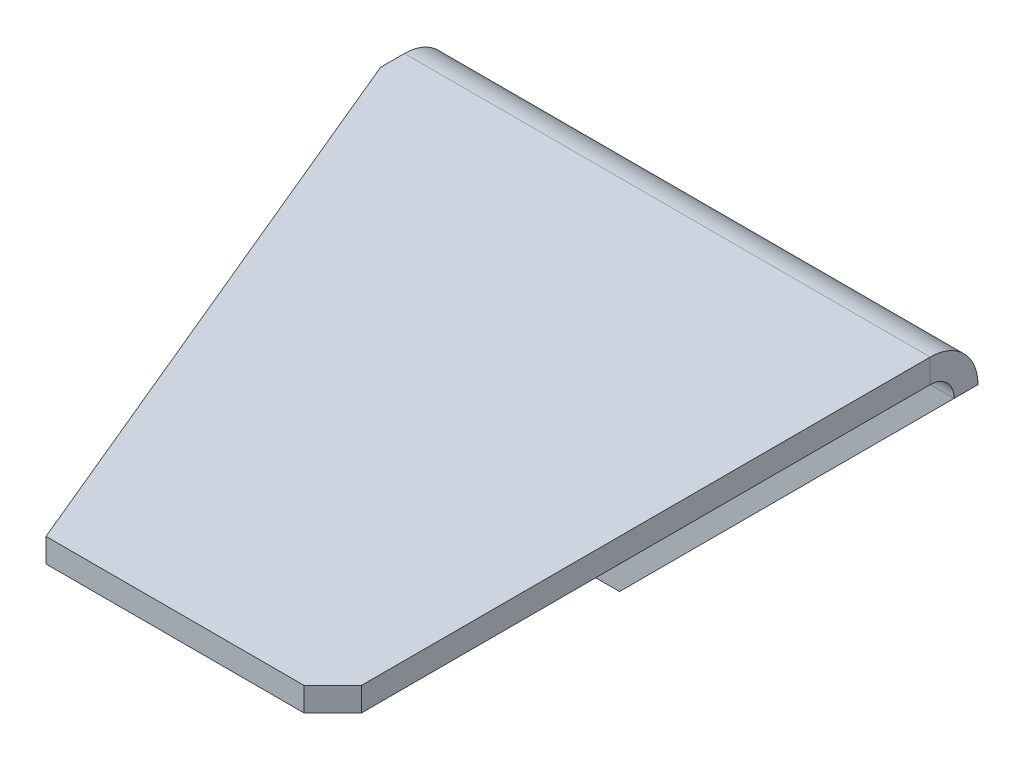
ISO-10303-21;
HEADER;
FILE_DESCRIPTION(('STEP AP214'),'2;1');
FILE_NAME('part.step','',(''),(''),'','','');
FILE_SCHEMA(('AUTOMOTIVE_DESIGN { 1 0 10303 214 1 1 1 1 }'));
ENDSEC;
DATA;
#1=APPLICATION_CONTEXT('core data for automotive mechanical design processes');
#2=APPLICATION_PROTOCOL_DEFINITION('international standard','automotive_design',2000,#1);
#3=PRODUCT_CONTEXT('',#1,'mechanical');
#4=PRODUCT('Part','Part','',(#3));
#5=PRODUCT_RELATED_PRODUCT_CATEGORY('part','',(#4));
#6=PRODUCT_DEFINITION_FORMATION('','',#4);
#7=PRODUCT_DEFINITION_CONTEXT('part definition',#1,'design');
#8=PRODUCT_DEFINITION('design','',#6,#7);
#9=PRODUCT_DEFINITION_SHAPE('','',#8);
#10=(LENGTH_UNIT() NAMED_UNIT(*) SI_UNIT(.MILLI.,.METRE.));
#11=(NAMED_UNIT(*) PLANE_ANGLE_UNIT() SI_UNIT($,.RADIAN.));
#12=(NAMED_UNIT(*) SI_UNIT($,.STERADIAN.) SOLID_ANGLE_UNIT());
#13=UNCERTAINTY_MEASURE_WITH_UNIT(LENGTH_MEASURE(1.E-05),#10,'distance_accuracy_value','');
#14=(GEOMETRIC_REPRESENTATION_CONTEXT(3) GLOBAL_UNCERTAINTY_ASSIGNED_CONTEXT((#13)) GLOBAL_UNIT_ASSIGNED_CONTEXT((#10,
#11,#12)) REPRESENTATION_CONTEXT('',''));
#15=CARTESIAN_POINT('',(0.,0.,0.));
#16=DIRECTION('',(0.,0.,1.));
#17=DIRECTION('',(1.,0.,0.));
#18=AXIS2_PLACEMENT_3D('',#15,#16,#17);
#19=CARTESIAN_POINT('',(-962.500000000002,-5.00000000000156,-67.4999999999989));
#20=DIRECTION('',(-1.,0.,0.));
#21=DIRECTION('',(0.,0.,-1.));
#22=AXIS2_PLACEMENT_3D('',#19,#20,#21);
#23=PLANE('',#22);
#24=DIRECTION('',(0.,0.,1.));
#25=VECTOR('',#24,1.);
#26=CARTESIAN_POINT('',(-962.500000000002,-5.00000000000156,-67.4999999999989));
#27=LINE('',#26,#25);
#28=CARTESIAN_POINT('',(-962.500000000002,-5.00000000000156,-67.4999999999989));
#29=VERTEX_POINT('',#28);
#30=CARTESIAN_POINT('',(-962.500000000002,-5.00000000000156,-64.999999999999));
#31=VERTEX_POINT('',#30);
#32=EDGE_CURVE('E278',#29,#31,#27,.T.);
#33=ORIENTED_EDGE('',*,*,#32,.T.);
#34=CARTESIAN_POINT('',(-962.500000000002,-5.00000000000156,-62.4999999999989));
#35=DIRECTION('',(1.,0.,0.));
#36=DIRECTION('',(0.,0.,-1.));
#37=AXIS2_PLACEMENT_3D('',#34,#35,#36);
#38=CIRCLE('',#37,2.5);
#39=CARTESIAN_POINT('',(-962.500000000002,-2.50000000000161,-62.4999999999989));
#40=VERTEX_POINT('',#39);
#41=EDGE_CURVE('E234',#40,#31,#38,.F.);
#42=ORIENTED_EDGE('',*,*,#41,.F.);
#43=DIRECTION('',(0.,1.,0.));
#44=VECTOR('',#43,1.);
#45=CARTESIAN_POINT('',(-962.500000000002,-2.50000000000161,-62.4999999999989));
#46=LINE('',#45,#44);
#47=CARTESIAN_POINT('',(-962.500000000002,-1.55431223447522E-12,-62.4999999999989));
#48=VERTEX_POINT('',#47);
#49=EDGE_CURVE('E274',#40,#48,#46,.T.);
#50=ORIENTED_EDGE('',*,*,#49,.T.);
#51=CARTESIAN_POINT('',(-962.500000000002,-5.00000000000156,-62.4999999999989));
#52=DIRECTION('',(1.,0.,0.));
#53=DIRECTION('',(0.,0.,-1.));
#54=AXIS2_PLACEMENT_3D('',#51,#52,#53);
#55=CIRCLE('',#54,5.);
#56=EDGE_CURVE('E223',#48,#29,#55,.F.);
#57=ORIENTED_EDGE('',*,*,#56,.T.);
#58=EDGE_LOOP('',(#33,#42,#50,#57));
#59=FACE_BOUND('',#58,.T.);
#60=ADVANCED_FACE('F38',(#59),#23,.T.);
#61=CARTESIAN_POINT('',(-962.500000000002,-2.50000000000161,-62.4999999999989));
#62=DIRECTION('',(-1.,0.,0.));
#63=DIRECTION('',(0.,0.,-1.));
#64=AXIS2_PLACEMENT_3D('',#61,#62,#63);
#65=PLANE('',#64);
#66=DIRECTION('',(0.,-1.,0.));
#67=VECTOR('',#66,1.);
#68=CARTESIAN_POINT('',(-962.500000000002,-1.55431223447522E-12,-67.4999999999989));
#69=LINE('',#68,#67);
#70=CARTESIAN_POINT('',(-962.500000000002,-40.0000000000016,-67.4999999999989));
#71=VERTEX_POINT('',#70);
#72=EDGE_CURVE('E219',#29,#71,#69,.T.);
#73=ORIENTED_EDGE('',*,*,#72,.T.);
#74=DIRECTION('',(0.,0.,1.));
#75=VECTOR('',#74,1.);
#76=CARTESIAN_POINT('',(-962.500000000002,-40.0000000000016,-67.4999999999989));
#77=LINE('',#76,#75);
#78=CARTESIAN_POINT('',(-962.500000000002,-40.0000000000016,-64.999999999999));
#79=VERTEX_POINT('',#78);
#80=EDGE_CURVE('E215',#71,#79,#77,.T.);
#81=ORIENTED_EDGE('',*,*,#80,.T.);
#82=DIRECTION('',(0.,1.,0.));
#83=VECTOR('',#82,1.);
#84=CARTESIAN_POINT('',(-962.500000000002,-1.55431223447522E-12,-64.999999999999));
#85=LINE('',#84,#83);
#86=EDGE_CURVE('E211',#31,#79,#85,.F.);
#87=ORIENTED_EDGE('',*,*,#86,.F.);
#88=ORIENTED_EDGE('',*,*,#32,.F.);
#89=EDGE_LOOP('',(#73,#81,#87,#88));
#90=FACE_BOUND('',#89,.T.);
#91=ADVANCED_FACE('F350',(#90),#65,.T.);
#92=CARTESIAN_POINT('',(-907.500000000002,-1.55431223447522E-12,-62.4999999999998));
#93=DIRECTION('',(1.,0.,0.));
#94=DIRECTION('',(0.,0.,1.));
#95=AXIS2_PLACEMENT_3D('',#92,#93,#94);
#96=PLANE('',#95);
#97=DIRECTION('',(0.,-1.,0.));
#98=VECTOR('',#97,1.);
#99=CARTESIAN_POINT('',(-907.500000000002,-1.55431223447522E-12,-62.4999999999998));
#100=LINE('',#99,#98);
#101=CARTESIAN_POINT('',(-907.500000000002,-1.55431223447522E-12,-62.4999999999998));
#102=VERTEX_POINT('',#101);
#103=CARTESIAN_POINT('',(-907.500000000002,-2.50000000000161,-62.4999999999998));
#104=VERTEX_POINT('',#103);
#105=EDGE_CURVE('E270',#102,#104,#100,.T.);
#106=ORIENTED_EDGE('',*,*,#105,.T.);
#107=CARTESIAN_POINT('',(-907.500000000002,-5.00000000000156,-62.4999999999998));
#108=DIRECTION('',(1.,0.,0.));
#109=DIRECTION('',(0.,0.,-1.));
#110=AXIS2_PLACEMENT_3D('',#107,#108,#109);
#111=CIRCLE('',#110,2.5);
#112=CARTESIAN_POINT('',(-907.500000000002,-5.00000000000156,-64.9999999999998));
#113=VERTEX_POINT('',#112);
#114=EDGE_CURVE('E207',#104,#113,#111,.F.);
#115=ORIENTED_EDGE('',*,*,#114,.T.);
#116=DIRECTION('',(0.,0.,-1.));
#117=VECTOR('',#116,1.);
#118=CARTESIAN_POINT('',(-907.500000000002,-5.00000000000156,-64.9999999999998));
#119=LINE('',#118,#117);
#120=CARTESIAN_POINT('',(-907.500000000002,-5.00000000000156,-67.4999999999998));
#121=VERTEX_POINT('',#120);
#122=EDGE_CURVE('E266',#113,#121,#119,.T.);
#123=ORIENTED_EDGE('',*,*,#122,.T.);
#124=CARTESIAN_POINT('',(-907.500000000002,-5.00000000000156,-62.4999999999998));
#125=DIRECTION('',(1.,0.,0.));
#126=DIRECTION('',(0.,0.,-1.));
#127=AXIS2_PLACEMENT_3D('',#124,#125,#126);
#128=CIRCLE('',#127,5.);
#129=EDGE_CURVE('E191',#102,#121,#128,.F.);
#130=ORIENTED_EDGE('',*,*,#129,.F.);
#131=EDGE_LOOP('',(#106,#115,#123,#130));
#132=FACE_BOUND('',#131,.T.);
#133=ADVANCED_FACE('F344',(#132),#96,.T.);
#134=CARTESIAN_POINT('',(-907.500000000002,-5.00000000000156,-64.9999999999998));
#135=DIRECTION('',(1.,0.,0.));
#136=DIRECTION('',(0.,0.,1.));
#137=AXIS2_PLACEMENT_3D('',#134,#135,#136);
#138=PLANE('',#137);
#139=DIRECTION('',(0.,0.,-1.));
#140=VECTOR('',#139,1.);
#141=CARTESIAN_POINT('',(-907.5,-2.50000000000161,1.11022302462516E-13));
#142=LINE('',#141,#140);
#143=CARTESIAN_POINT('',(-907.5,-2.50000000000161,-2.99999999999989));
#144=VERTEX_POINT('',#143);
#145=EDGE_CURVE('E203',#144,#104,#142,.T.);
#146=ORIENTED_EDGE('',*,*,#145,.T.);
#147=ORIENTED_EDGE('',*,*,#105,.F.);
#148=DIRECTION('',(0.,0.,-1.));
#149=VECTOR('',#148,1.);
#150=CARTESIAN_POINT('',(-907.5,-1.55431223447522E-12,1.11022302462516E-13));
#151=LINE('',#150,#149);
#152=CARTESIAN_POINT('',(-907.5,-1.55431223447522E-12,-2.99999999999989));
#153=VERTEX_POINT('',#152);
#154=EDGE_CURVE('E199',#153,#102,#151,.T.);
#155=ORIENTED_EDGE('',*,*,#154,.F.);
#156=DIRECTION('',(0.,1.,0.));
#157=VECTOR('',#156,1.);
#158=CARTESIAN_POINT('',(-907.5,-5.00000000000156,-2.99999999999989));
#159=LINE('',#158,#157);
#160=EDGE_CURVE('E305',#144,#153,#159,.T.);
#161=ORIENTED_EDGE('',*,*,#160,.F.);
#162=EDGE_LOOP('',(#146,#147,#155,#161));
#163=FACE_BOUND('',#162,.T.);
#164=ADVANCED_FACE('F337',(#163),#138,.T.);
#165=CARTESIAN_POINT('',(-962.500000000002,-1.55431223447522E-12,-64.999999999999));
#166=DIRECTION('',(0.,0.,-1.));
#167=DIRECTION('',(1.,0.,0.));
#168=AXIS2_PLACEMENT_3D('',#165,#166,#167);
#169=PLANE('',#168);
#170=DIRECTION('',(0.,1.,0.));
#171=VECTOR('',#170,1.);
#172=CARTESIAN_POINT('',(-956.75,-29.7499999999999,-64.999999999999));
#173=LINE('',#172,#171);
#174=CARTESIAN_POINT('',(-956.75,-29.7499999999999,-64.999999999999));
#175=VERTEX_POINT('',#174);
#176=CARTESIAN_POINT('',(-956.75,-20.2499999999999,-64.999999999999));
#177=VERTEX_POINT('',#176);
#178=EDGE_CURVE('E142',#175,#177,#173,.T.);
#179=ORIENTED_EDGE('',*,*,#178,.T.);
#180=CARTESIAN_POINT('',(-952.5,-20.2499999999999,-64.999999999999));
#181=DIRECTION('',(0.,0.,-1.));
#182=DIRECTION('',(-1.,0.,0.));
#183=AXIS2_PLACEMENT_3D('',#180,#181,#182);
#184=CIRCLE('',#183,4.25);
#185=CARTESIAN_POINT('',(-948.25,-20.2499999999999,-64.999999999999));
#186=VERTEX_POINT('',#185);
#187=EDGE_CURVE('E153',#177,#186,#184,.T.);
#188=ORIENTED_EDGE('',*,*,#187,.T.);
#189=DIRECTION('',(0.,-1.,0.));
#190=VECTOR('',#189,1.);
#191=CARTESIAN_POINT('',(-948.25,-29.7499999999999,-64.999999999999));
#192=LINE('',#191,#190);
#193=CARTESIAN_POINT('',(-948.25,-29.7499999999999,-64.999999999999));
#194=VERTEX_POINT('',#193);
#195=EDGE_CURVE('E159',#186,#194,#192,.T.);
#196=ORIENTED_EDGE('',*,*,#195,.T.);
#197=CARTESIAN_POINT('',(-952.5,-29.7499999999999,-64.999999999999));
#198=DIRECTION('',(0.,0.,-1.));
#199=DIRECTION('',(1.,0.,0.));
#200=AXIS2_PLACEMENT_3D('',#197,#198,#199);
#201=CIRCLE('',#200,4.25);
#202=EDGE_CURVE('E165',#194,#175,#201,.T.);
#203=ORIENTED_EDGE('',*,*,#202,.T.);
#204=EDGE_LOOP('',(#179,#188,#196,#203));
#205=FACE_BOUND('',#204,.T.);
#206=DIRECTION('',(1.,0.,0.));
#207=VECTOR('',#206,1.);
#208=CARTESIAN_POINT('',(-962.500000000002,-5.00000000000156,-64.999999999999));
#209=LINE('',#208,#207);
#210=EDGE_CURVE('E237',#31,#113,#209,.T.);
#211=ORIENTED_EDGE('',*,*,#210,.F.);
#212=ORIENTED_EDGE('',*,*,#86,.T.);
#213=DIRECTION('',(1.,0.,0.));
#214=VECTOR('',#213,1.);
#215=CARTESIAN_POINT('',(-962.500000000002,-40.0000000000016,-64.999999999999));
#216=LINE('',#215,#214);
#217=CARTESIAN_POINT('',(-942.500000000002,-40.,-64.999999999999));
#218=VERTEX_POINT('',#217);
#219=EDGE_CURVE('E262',#79,#218,#216,.T.);
#220=ORIENTED_EDGE('',*,*,#219,.T.);
#221=DIRECTION('',(-0.707106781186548,-0.707106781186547,0.));
#222=VECTOR('',#221,1.);
#223=CARTESIAN_POINT('',(-907.500000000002,-5.00000000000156,-64.9999999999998));
#224=LINE('',#223,#222);
#225=EDGE_CURVE('E294',#113,#218,#224,.T.);
#226=ORIENTED_EDGE('',*,*,#225,.F.);
#227=EDGE_LOOP('',(#211,#212,#220,#226));
#228=FACE_BOUND('',#227,.T.);
#229=ADVANCED_FACE('F162',(#205,#228),#169,.F.);
#230=CARTESIAN_POINT('',(-962.500000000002,-40.0000000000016,-67.4999999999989));
#231=DIRECTION('',(0.,-1.,0.));
#232=DIRECTION('',(0.,0.,-1.));
#233=AXIS2_PLACEMENT_3D('',#230,#231,#232);
#234=PLANE('',#233);
#235=ORIENTED_EDGE('',*,*,#219,.F.);
#236=ORIENTED_EDGE('',*,*,#80,.F.);
#237=DIRECTION('',(1.,0.,0.));
#238=VECTOR('',#237,1.);
#239=CARTESIAN_POINT('',(-962.500000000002,-40.0000000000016,-67.4999999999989));
#240=LINE('',#239,#238);
#241=CARTESIAN_POINT('',(-942.500000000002,-40.,-67.4999999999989));
#242=VERTEX_POINT('',#241);
#243=EDGE_CURVE('E258',#71,#242,#240,.T.);
#244=ORIENTED_EDGE('',*,*,#243,.T.);
#245=DIRECTION('',(0.,0.,-1.));
#246=VECTOR('',#245,1.);
#247=CARTESIAN_POINT('',(-942.500000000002,-40.,-67.4999999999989));
#248=LINE('',#247,#246);
#249=EDGE_CURVE('E298',#218,#242,#248,.T.);
#250=ORIENTED_EDGE('',*,*,#249,.F.);
#251=EDGE_LOOP('',(#235,#236,#244,#250));
#252=FACE_BOUND('',#251,.T.);
#253=ADVANCED_FACE('F357',(#252),#234,.T.);
#254=CARTESIAN_POINT('',(-962.500000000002,-1.55431223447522E-12,-67.4999999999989));
#255=DIRECTION('',(0.,0.,-1.));
#256=DIRECTION('',(1.,0.,0.));
#257=AXIS2_PLACEMENT_3D('',#254,#255,#256);
#258=PLANE('',#257);
#259=CARTESIAN_POINT('',(-952.5,-29.7499999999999,-67.4999999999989));
#260=DIRECTION('',(0.,0.,-1.));
#261=DIRECTION('',(1.,0.,0.));
#262=AXIS2_PLACEMENT_3D('',#259,#260,#261);
#263=CIRCLE('',#262,4.25);
#264=CARTESIAN_POINT('',(-948.25,-29.7499999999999,-67.4999999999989));
#265=VERTEX_POINT('',#264);
#266=CARTESIAN_POINT('',(-956.75,-29.7499999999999,-67.4999999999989));
#267=VERTEX_POINT('',#266);
#268=EDGE_CURVE('E175',#265,#267,#263,.T.);
#269=ORIENTED_EDGE('',*,*,#268,.F.);
#270=DIRECTION('',(0.,-1.,0.));
#271=VECTOR('',#270,1.);
#272=CARTESIAN_POINT('',(-948.25,-29.7499999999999,-67.4999999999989));
#273=LINE('',#272,#271);
#274=CARTESIAN_POINT('',(-948.25,-20.2499999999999,-67.4999999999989));
#275=VERTEX_POINT('',#274);
#276=EDGE_CURVE('E184',#275,#265,#273,.T.);
#277=ORIENTED_EDGE('',*,*,#276,.F.);
#278=CARTESIAN_POINT('',(-952.5,-20.2499999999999,-67.4999999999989));
#279=DIRECTION('',(0.,0.,-1.));
#280=DIRECTION('',(-1.,0.,0.));
#281=AXIS2_PLACEMENT_3D('',#278,#279,#280);
#282=CIRCLE('',#281,4.25);
#283=CARTESIAN_POINT('',(-956.75,-20.2499999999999,-67.4999999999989));
#284=VERTEX_POINT('',#283);
#285=EDGE_CURVE('E181',#284,#275,#282,.T.);
#286=ORIENTED_EDGE('',*,*,#285,.F.);
#287=DIRECTION('',(0.,1.,0.));
#288=VECTOR('',#287,1.);
#289=CARTESIAN_POINT('',(-956.75,-29.7499999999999,-67.4999999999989));
#290=LINE('',#289,#288);
#291=EDGE_CURVE('E144',#267,#284,#290,.T.);
#292=ORIENTED_EDGE('',*,*,#291,.F.);
#293=EDGE_LOOP('',(#269,#277,#286,#292));
#294=FACE_BOUND('',#293,.T.);
#295=ORIENTED_EDGE('',*,*,#243,.F.);
#296=ORIENTED_EDGE('',*,*,#72,.F.);
#297=DIRECTION('',(1.,0.,0.));
#298=VECTOR('',#297,1.);
#299=CARTESIAN_POINT('',(-962.500000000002,-5.00000000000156,-67.4999999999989));
#300=LINE('',#299,#298);
#301=EDGE_CURVE('E254',#29,#121,#300,.T.);
#302=ORIENTED_EDGE('',*,*,#301,.T.);
#303=DIRECTION('',(0.707106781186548,0.707106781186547,0.));
#304=VECTOR('',#303,1.);
#305=CARTESIAN_POINT('',(-932.5,-29.9999999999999,-67.4999999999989));
#306=LINE('',#305,#304);
#307=EDGE_CURVE('E302',#242,#121,#306,.T.);
#308=ORIENTED_EDGE('',*,*,#307,.F.);
#309=EDGE_LOOP('',(#295,#296,#302,#308));
#310=FACE_BOUND('',#309,.T.);
#311=ADVANCED_FACE('F355',(#294,#310),#258,.T.);
#312=CARTESIAN_POINT('',(-962.500000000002,-5.00000000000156,-62.4999999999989));
#313=DIRECTION('',(1.,0.,0.));
#314=DIRECTION('',(0.,0.,1.));
#315=AXIS2_PLACEMENT_3D('',#312,#313,#314);
#316=CYLINDRICAL_SURFACE('',#315,5.);
#317=ORIENTED_EDGE('',*,*,#129,.T.);
#318=ORIENTED_EDGE('',*,*,#301,.F.);
#319=ORIENTED_EDGE('',*,*,#56,.F.);
#320=DIRECTION('',(1.,0.,0.));
#321=VECTOR('',#320,1.);
#322=CARTESIAN_POINT('',(-962.500000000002,-1.55431223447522E-12,-62.4999999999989));
#323=LINE('',#322,#321);
#324=EDGE_CURVE('E251',#48,#102,#323,.T.);
#325=ORIENTED_EDGE('',*,*,#324,.T.);
#326=EDGE_LOOP('',(#317,#318,#319,#325));
#327=FACE_BOUND('',#326,.T.);
#328=ADVANCED_FACE('F346',(#327),#316,.T.);
#329=CARTESIAN_POINT('',(-962.5,-1.55431223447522E-12,1.11022302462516E-13));
#330=DIRECTION('',(0.,1.,0.));
#331=DIRECTION('',(0.,0.,1.));
#332=AXIS2_PLACEMENT_3D('',#329,#330,#331);
#333=PLANE('',#332);
#334=ORIENTED_EDGE('',*,*,#154,.T.);
#335=ORIENTED_EDGE('',*,*,#324,.F.);
#336=DIRECTION('',(0.,0.,-1.));
#337=VECTOR('',#336,1.);
#338=CARTESIAN_POINT('',(-962.5,-1.55431223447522E-12,1.11022302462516E-13));
#339=LINE('',#338,#337);
#340=CARTESIAN_POINT('',(-962.500000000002,-1.55431223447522E-12,-59.9999999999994));
#341=VERTEX_POINT('',#340);
#342=EDGE_CURVE('E227',#341,#48,#339,.T.);
#343=ORIENTED_EDGE('',*,*,#342,.F.);
#344=DIRECTION('',(0.384615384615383,0.,0.923076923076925));
#345=VECTOR('',#344,1.);
#346=CARTESIAN_POINT('',(-941.198224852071,0.,-8.87573964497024));
#347=LINE('',#346,#345);
#348=CARTESIAN_POINT('',(-937.5,0.,1.11022302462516E-13));
#349=VERTEX_POINT('',#348);
#350=EDGE_CURVE('E285',#349,#341,#347,.F.);
#351=ORIENTED_EDGE('',*,*,#350,.F.);
#352=DIRECTION('',(1.,0.,0.));
#353=VECTOR('',#352,1.);
#354=CARTESIAN_POINT('',(-962.5,-1.55431223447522E-12,1.11022302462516E-13));
#355=LINE('',#354,#353);
#356=CARTESIAN_POINT('',(-910.5,-1.55431223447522E-12,1.11022302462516E-13));
#357=VERTEX_POINT('',#356);
#358=EDGE_CURVE('E247',#349,#357,#355,.T.);
#359=ORIENTED_EDGE('',*,*,#358,.T.);
#360=DIRECTION('',(0.707106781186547,0.,-0.707106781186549));
#361=VECTOR('',#360,1.);
#362=CARTESIAN_POINT('',(-936.5,0.,26.0000000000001));
#363=LINE('',#362,#361);
#364=EDGE_CURVE('E309',#153,#357,#363,.F.);
#365=ORIENTED_EDGE('',*,*,#364,.F.);
#366=EDGE_LOOP('',(#334,#335,#343,#351,#359,#365));
#367=FACE_BOUND('',#366,.T.);
#368=ADVANCED_FACE('F341',(#367),#333,.T.);
#369=CARTESIAN_POINT('',(-962.5,-2.50000000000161,1.11022302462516E-13));
#370=DIRECTION('',(0.,0.,1.));
#371=DIRECTION('',(-1.,0.,0.));
#372=AXIS2_PLACEMENT_3D('',#369,#370,#371);
#373=PLANE('',#372);
#374=ORIENTED_EDGE('',*,*,#358,.F.);
#375=DIRECTION('',(0.,1.,0.));
#376=VECTOR('',#375,1.);
#377=CARTESIAN_POINT('',(-937.5,-2.49999999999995,1.11022302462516E-13));
#378=LINE('',#377,#376);
#379=CARTESIAN_POINT('',(-937.5,-2.49999999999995,1.11022302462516E-13));
#380=VERTEX_POINT('',#379);
#381=EDGE_CURVE('E282',#380,#349,#378,.T.);
#382=ORIENTED_EDGE('',*,*,#381,.F.);
#383=DIRECTION('',(1.,0.,0.));
#384=VECTOR('',#383,1.);
#385=CARTESIAN_POINT('',(-962.5,-2.50000000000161,1.11022302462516E-13));
#386=LINE('',#385,#384);
#387=CARTESIAN_POINT('',(-910.5,-2.50000000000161,1.11022302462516E-13));
#388=VERTEX_POINT('',#387);
#389=EDGE_CURVE('E244',#380,#388,#386,.T.);
#390=ORIENTED_EDGE('',*,*,#389,.T.);
#391=DIRECTION('',(0.,-1.,0.));
#392=VECTOR('',#391,1.);
#393=CARTESIAN_POINT('',(-910.5,-2.50000000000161,1.11022302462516E-13));
#394=LINE('',#393,#392);
#395=EDGE_CURVE('E46',#357,#388,#394,.T.);
#396=ORIENTED_EDGE('',*,*,#395,.F.);
#397=EDGE_LOOP('',(#374,#382,#390,#396));
#398=FACE_BOUND('',#397,.T.);
#399=ADVANCED_FACE('F316',(#398),#373,.T.);
#400=CARTESIAN_POINT('',(-962.5,-2.50000000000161,1.11022302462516E-13));
#401=DIRECTION('',(0.,1.,0.));
#402=DIRECTION('',(0.,0.,1.));
#403=AXIS2_PLACEMENT_3D('',#400,#401,#402);
#404=PLANE('',#403);
#405=ORIENTED_EDGE('',*,*,#389,.F.);
#406=DIRECTION('',(-0.384615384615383,0.,-0.923076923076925));
#407=VECTOR('',#406,1.);
#408=CARTESIAN_POINT('',(-937.5,-2.49999999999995,1.11022302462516E-13));
#409=LINE('',#408,#407);
#410=CARTESIAN_POINT('',(-962.500000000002,-2.50000000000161,-59.9999999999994));
#411=VERTEX_POINT('',#410);
#412=EDGE_CURVE('E291',#411,#380,#409,.F.);
#413=ORIENTED_EDGE('',*,*,#412,.F.);
#414=DIRECTION('',(0.,0.,-1.));
#415=VECTOR('',#414,1.);
#416=CARTESIAN_POINT('',(-962.5,-2.50000000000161,1.11022302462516E-13));
#417=LINE('',#416,#415);
#418=EDGE_CURVE('E230',#411,#40,#417,.T.);
#419=ORIENTED_EDGE('',*,*,#418,.T.);
#420=DIRECTION('',(1.,0.,0.));
#421=VECTOR('',#420,1.);
#422=CARTESIAN_POINT('',(-962.500000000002,-2.50000000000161,-62.4999999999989));
#423=LINE('',#422,#421);
#424=EDGE_CURVE('E241',#40,#104,#423,.T.);
#425=ORIENTED_EDGE('',*,*,#424,.T.);
#426=ORIENTED_EDGE('',*,*,#145,.F.);
#427=DIRECTION('',(-0.707106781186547,0.,0.707106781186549));
#428=VECTOR('',#427,1.);
#429=CARTESIAN_POINT('',(-907.5,-2.50000000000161,-2.99999999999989));
#430=LINE('',#429,#428);
#431=EDGE_CURVE('E11',#388,#144,#430,.F.);
#432=ORIENTED_EDGE('',*,*,#431,.F.);
#433=EDGE_LOOP('',(#405,#413,#419,#425,#426,#432));
#434=FACE_BOUND('',#433,.T.);
#435=ADVANCED_FACE('F318',(#434),#404,.F.);
#436=CARTESIAN_POINT('',(-962.500000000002,-5.00000000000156,-62.4999999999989));
#437=DIRECTION('',(1.,0.,0.));
#438=DIRECTION('',(0.,0.,1.));
#439=AXIS2_PLACEMENT_3D('',#436,#437,#438);
#440=CYLINDRICAL_SURFACE('',#439,2.5);
#441=ORIENTED_EDGE('',*,*,#114,.F.);
#442=ORIENTED_EDGE('',*,*,#424,.F.);
#443=ORIENTED_EDGE('',*,*,#41,.T.);
#444=ORIENTED_EDGE('',*,*,#210,.T.);
#445=EDGE_LOOP('',(#441,#442,#443,#444));
#446=FACE_BOUND('',#445,.T.);
#447=ADVANCED_FACE('F333',(#446),#440,.F.);
#448=CARTESIAN_POINT('',(-962.500000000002,-5.00000000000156,-62.4999999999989));
#449=DIRECTION('',(-1.,0.,0.));
#450=DIRECTION('',(0.,0.,-1.));
#451=AXIS2_PLACEMENT_3D('',#448,#449,#450);
#452=PLANE('',#451);
#453=ORIENTED_EDGE('',*,*,#342,.T.);
#454=ORIENTED_EDGE('',*,*,#49,.F.);
#455=ORIENTED_EDGE('',*,*,#418,.F.);
#456=DIRECTION('',(0.,-1.,0.));
#457=VECTOR('',#456,1.);
#458=CARTESIAN_POINT('',(-962.500000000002,-5.00000000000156,-59.9999999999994));
#459=LINE('',#458,#457);
#460=EDGE_CURVE('E288',#341,#411,#459,.T.);
#461=ORIENTED_EDGE('',*,*,#460,.F.);
#462=EDGE_LOOP('',(#453,#454,#455,#461));
#463=FACE_BOUND('',#462,.T.);
#464=ADVANCED_FACE('F326',(#463),#452,.T.);
#465=CARTESIAN_POINT('',(-952.5,-29.7499999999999,-67.4999999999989));
#466=DIRECTION('',(0.,0.,1.));
#467=DIRECTION('',(-1.,0.,0.));
#468=AXIS2_PLACEMENT_3D('',#465,#466,#467);
#469=CYLINDRICAL_SURFACE('',#468,4.25);
#470=ORIENTED_EDGE('',*,*,#202,.F.);
#471=DIRECTION('',(0.,0.,1.));
#472=VECTOR('',#471,1.);
#473=CARTESIAN_POINT('',(-948.25,-29.7499999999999,-67.4999999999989));
#474=LINE('',#473,#472);
#475=EDGE_CURVE('E188',#265,#194,#474,.T.);
#476=ORIENTED_EDGE('',*,*,#475,.F.);
#477=ORIENTED_EDGE('',*,*,#268,.T.);
#478=DIRECTION('',(0.,0.,1.));
#479=VECTOR('',#478,1.);
#480=CARTESIAN_POINT('',(-956.75,-29.7499999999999,-67.4999999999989));
#481=LINE('',#480,#479);
#482=EDGE_CURVE('E150',#267,#175,#481,.T.);
#483=ORIENTED_EDGE('',*,*,#482,.T.);
#484=EDGE_LOOP('',(#470,#476,#477,#483));
#485=FACE_BOUND('',#484,.T.);
#486=ADVANCED_FACE('F436',(#485),#469,.F.);
#487=CARTESIAN_POINT('',(-948.25,-29.7499999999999,-67.4999999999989));
#488=DIRECTION('',(1.,0.,0.));
#489=DIRECTION('',(0.,0.,1.));
#490=AXIS2_PLACEMENT_3D('',#487,#488,#489);
#491=PLANE('',#490);
#492=ORIENTED_EDGE('',*,*,#195,.F.);
#493=DIRECTION('',(0.,0.,1.));
#494=VECTOR('',#493,1.);
#495=CARTESIAN_POINT('',(-948.25,-20.2499999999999,-67.4999999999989));
#496=LINE('',#495,#494);
#497=EDGE_CURVE('E149',#275,#186,#496,.T.);
#498=ORIENTED_EDGE('',*,*,#497,.F.);
#499=ORIENTED_EDGE('',*,*,#276,.T.);
#500=ORIENTED_EDGE('',*,*,#475,.T.);
#501=EDGE_LOOP('',(#492,#498,#499,#500));
#502=FACE_BOUND('',#501,.T.);
#503=ADVANCED_FACE('F444',(#502),#491,.F.);
#504=CARTESIAN_POINT('',(-952.5,-20.2499999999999,-67.4999999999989));
#505=DIRECTION('',(0.,0.,1.));
#506=DIRECTION('',(-1.,0.,0.));
#507=AXIS2_PLACEMENT_3D('',#504,#505,#506);
#508=CYLINDRICAL_SURFACE('',#507,4.25);
#509=ORIENTED_EDGE('',*,*,#187,.F.);
#510=DIRECTION('',(0.,0.,1.));
#511=VECTOR('',#510,1.);
#512=CARTESIAN_POINT('',(-956.75,-20.2499999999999,-67.4999999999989));
#513=LINE('',#512,#511);
#514=EDGE_CURVE('E138',#284,#177,#513,.T.);
#515=ORIENTED_EDGE('',*,*,#514,.F.);
#516=ORIENTED_EDGE('',*,*,#285,.T.);
#517=ORIENTED_EDGE('',*,*,#497,.T.);
#518=EDGE_LOOP('',(#509,#515,#516,#517));
#519=FACE_BOUND('',#518,.T.);
#520=ADVANCED_FACE('F154',(#519),#508,.F.);
#521=CARTESIAN_POINT('',(-956.75,-29.7499999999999,-67.4999999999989));
#522=DIRECTION('',(-1.,0.,0.));
#523=DIRECTION('',(0.,0.,-1.));
#524=AXIS2_PLACEMENT_3D('',#521,#522,#523);
#525=PLANE('',#524);
#526=ORIENTED_EDGE('',*,*,#178,.F.);
#527=ORIENTED_EDGE('',*,*,#482,.F.);
#528=ORIENTED_EDGE('',*,*,#291,.T.);
#529=ORIENTED_EDGE('',*,*,#514,.T.);
#530=EDGE_LOOP('',(#526,#527,#528,#529));
#531=FACE_BOUND('',#530,.T.);
#532=ADVANCED_FACE('F140',(#531),#525,.F.);
#533=CARTESIAN_POINT('',(-937.5,-2.49999999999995,1.11022302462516E-13));
#534=DIRECTION('',(0.923076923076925,0.,-0.384615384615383));
#535=DIRECTION('',(0.384615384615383,0.,0.923076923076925));
#536=AXIS2_PLACEMENT_3D('',#533,#534,#535);
#537=PLANE('',#536);
#538=ORIENTED_EDGE('',*,*,#412,.T.);
#539=ORIENTED_EDGE('',*,*,#381,.T.);
#540=ORIENTED_EDGE('',*,*,#350,.T.);
#541=ORIENTED_EDGE('',*,*,#460,.T.);
#542=EDGE_LOOP('',(#538,#539,#540,#541));
#543=FACE_BOUND('',#542,.T.);
#544=ADVANCED_FACE('F322',(#543),#537,.F.);
#545=CARTESIAN_POINT('',(-907.500000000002,-5.00000000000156,-62.4999999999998));
#546=DIRECTION('',(0.707106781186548,-0.707106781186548,0.));
#547=DIRECTION('',(-0.707106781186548,-0.707106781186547,0.));
#548=AXIS2_PLACEMENT_3D('',#545,#546,#547);
#549=PLANE('',#548);
#550=ORIENTED_EDGE('',*,*,#307,.T.);
#551=ORIENTED_EDGE('',*,*,#122,.F.);
#552=ORIENTED_EDGE('',*,*,#225,.T.);
#553=ORIENTED_EDGE('',*,*,#249,.T.);
#554=EDGE_LOOP('',(#550,#551,#552,#553));
#555=FACE_BOUND('',#554,.T.);
#556=ADVANCED_FACE('F353',(#555),#549,.T.);
#557=CARTESIAN_POINT('',(-907.5,-5.00000000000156,-2.99999999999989));
#558=DIRECTION('',(-0.707106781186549,0.,-0.707106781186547));
#559=DIRECTION('',(0.707106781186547,0.,-0.707106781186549));
#560=AXIS2_PLACEMENT_3D('',#557,#558,#559);
#561=PLANE('',#560);
#562=ORIENTED_EDGE('',*,*,#431,.T.);
#563=ORIENTED_EDGE('',*,*,#160,.T.);
#564=ORIENTED_EDGE('',*,*,#364,.T.);
#565=ORIENTED_EDGE('',*,*,#395,.T.);
#566=EDGE_LOOP('',(#562,#563,#564,#565));
#567=FACE_BOUND('',#566,.T.);
#568=ADVANCED_FACE('F313',(#567),#561,.F.);
#569=CLOSED_SHELL('',(#60,#91,#133,#164,#229,#253,#311,#328,#368,#399,#435,#447,#464,#486,#503,
#520,#532,#544,#556,#568));
#570=MANIFOLD_SOLID_BREP('B2',#569);
#571=ADVANCED_BREP_SHAPE_REPRESENTATION('',(#18,#570),#14);
#572=SHAPE_DEFINITION_REPRESENTATION(#9,#571);
ENDSEC;
END-ISO-10303-21;
